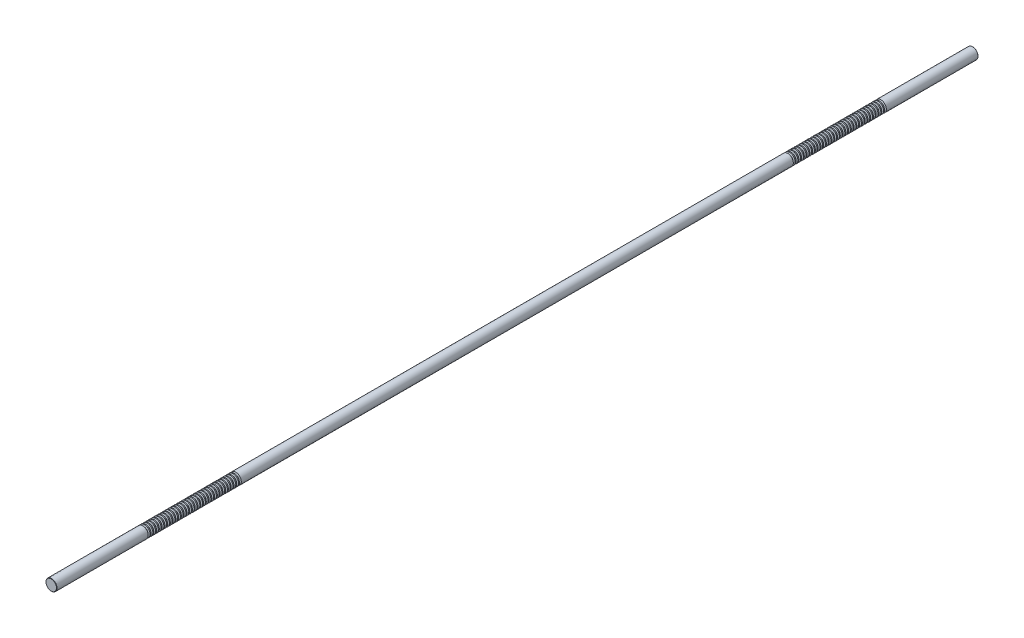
from build123d import *

# Parameters (mm, degrees)
SKETCH1_R           = 6
BOSS_EXTRUDE1_DEPTH = 500
CHAMFER1_SIZE       = 0.3
LPATTERN1_COUNT     = 34
LPATTERN1_PITCH     = 3
LPATTERN2_COUNT     = 2
LPATTERN2_PITCH     = 700


with BuildPart() as part:
    # Sketch1 → Boss-Extrude1 (new, symmetric)
    with BuildSketch(Plane.XY):
        Circle(SKETCH1_R)
    extrude(amount=BOSS_EXTRUDE1_DEPTH, both=True)

    # Chamfer1
    chamfer1_edges = [part.edges().sort_by_distance(p)[0] for p in [
        (-6, 0, -500),
        (-6, 0, 500),
    ]]
    chamfer(chamfer1_edges, length=CHAMFER1_SIZE)

    # Sketch2 → Cut-Revolve1 (revolve, cut)
    with BuildSketch(Plane(origin=(0, 0, 0), x_dir=(0, 0, -1), z_dir=(1, 0, 0)), mode=Mode.PRIVATE) as cut_revolve1_sk:
        Polygon((400.234455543, 6), (398.265544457, 6), (398.734455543, 4.25), (399.765544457, 4.25), align=None)
    cut_revolve1 = revolve(cut_revolve1_sk.sketch.rotate(Axis((0, 0, 500), (0, 0, -1)), 90), axis=Axis((0, 0, 500), (0, 0, -1)), mode=Mode.SUBTRACT)

    # LPattern1: Cut-Revolve1 ×34
    with Locations(*[(0, 0, i * LPATTERN1_PITCH) for i in range(1, LPATTERN1_COUNT)]):
        add(cut_revolve1, mode=Mode.SUBTRACT)

    # LPattern2: Cut-Revolve1 ×2
    with Locations(*[(0, 0, i * LPATTERN2_PITCH) for i in range(1, LPATTERN2_COUNT)]):
        add(cut_revolve1, mode=Mode.SUBTRACT)

    # LPattern2 copy 1 sketch → LPattern2 copy 1 (revolve, cut)
    with BuildSketch(Plane(origin=(0, 0, 703), x_dir=(0, 0, -1), z_dir=(1, 0, 0))):
        Polygon((400.234455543, 6), (398.265544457, 6), (398.734455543, 4.25), (399.765544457, 4.25), align=None)
    revolve(axis=Axis((0, 0, 1203), (0, 0, -1)), mode=Mode.SUBTRACT)

    # LPattern2 copy 2 sketch → LPattern2 copy 2 (revolve, cut)
    with BuildSketch(Plane(origin=(0, 0, 706), x_dir=(0, 0, -1), z_dir=(1, 0, 0))):
        Polygon((400.234455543, 6), (398.265544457, 6), (398.734455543, 4.25), (399.765544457, 4.25), align=None)
    revolve(axis=Axis((0, 0, 1206), (0, 0, -1)), mode=Mode.SUBTRACT)

    # LPattern2 copy 3 sketch → LPattern2 copy 3 (revolve, cut)
    with BuildSketch(Plane(origin=(0, 0, 709), x_dir=(0, 0, -1), z_dir=(1, 0, 0))):
        Polygon((400.234455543, 6), (398.265544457, 6), (398.734455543, 4.25), (399.765544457, 4.25), align=None)
    revolve(axis=Axis((0, 0, 1209), (0, 0, -1)), mode=Mode.SUBTRACT)

    # LPattern2 copy 4 sketch → LPattern2 copy 4 (revolve, cut)
    with BuildSketch(Plane(origin=(0, 0, 712), x_dir=(0, 0, -1), z_dir=(1, 0, 0))):
        Polygon((400.234455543, 6), (398.265544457, 6), (398.734455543, 4.25), (399.765544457, 4.25), align=None)
    revolve(axis=Axis((0, 0, 1212), (0, 0, -1)), mode=Mode.SUBTRACT)

    # LPattern2 copy 5 sketch → LPattern2 copy 5 (revolve, cut)
    with BuildSketch(Plane(origin=(0, 0, 715), x_dir=(0, 0, -1), z_dir=(1, 0, 0))):
        Polygon((400.234455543, 6), (398.265544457, 6), (398.734455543, 4.25), (399.765544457, 4.25), align=None)
    revolve(axis=Axis((0, 0, 1215), (0, 0, -1)), mode=Mode.SUBTRACT)

    # LPattern2 copy 6 sketch → LPattern2 copy 6 (revolve, cut)
    with BuildSketch(Plane(origin=(0, 0, 718), x_dir=(0, 0, -1), z_dir=(1, 0, 0))):
        Polygon((400.234455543, 6), (398.265544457, 6), (398.734455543, 4.25), (399.765544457, 4.25), align=None)
    revolve(axis=Axis((0, 0, 1218), (0, 0, -1)), mode=Mode.SUBTRACT)

    # LPattern2 copy 7 sketch → LPattern2 copy 7 (revolve, cut)
    with BuildSketch(Plane(origin=(0, 0, 721), x_dir=(0, 0, -1), z_dir=(1, 0, 0))):
        Polygon((400.234455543, 6), (398.265544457, 6), (398.734455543, 4.25), (399.765544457, 4.25), align=None)
    revolve(axis=Axis((0, 0, 1221), (0, 0, -1)), mode=Mode.SUBTRACT)

    # LPattern2 copy 8 sketch → LPattern2 copy 8 (revolve, cut)
    with BuildSketch(Plane(origin=(0, 0, 724), x_dir=(0, 0, -1), z_dir=(1, 0, 0))):
        Polygon((400.234455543, 6), (398.265544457, 6), (398.734455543, 4.25), (399.765544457, 4.25), align=None)
    revolve(axis=Axis((0, 0, 1224), (0, 0, -1)), mode=Mode.SUBTRACT)

    # LPattern2 copy 9 sketch → LPattern2 copy 9 (revolve, cut)
    with BuildSketch(Plane(origin=(0, 0, 727), x_dir=(0, 0, -1), z_dir=(1, 0, 0))):
        Polygon((400.234455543, 6), (398.265544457, 6), (398.734455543, 4.25), (399.765544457, 4.25), align=None)
    revolve(axis=Axis((0, 0, 1227), (0, 0, -1)), mode=Mode.SUBTRACT)

    # LPattern2 copy 10 sketch → LPattern2 copy 10 (revolve, cut)
    with BuildSketch(Plane(origin=(0, 0, 730), x_dir=(0, 0, -1), z_dir=(1, 0, 0))):
        Polygon((400.234455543, 6), (398.265544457, 6), (398.734455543, 4.25), (399.765544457, 4.25), align=None)
    revolve(axis=Axis((0, 0, 1230), (0, 0, -1)), mode=Mode.SUBTRACT)

    # LPattern2 copy 11 sketch → LPattern2 copy 11 (revolve, cut)
    with BuildSketch(Plane(origin=(0, 0, 733), x_dir=(0, 0, -1), z_dir=(1, 0, 0))):
        Polygon((400.234455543, 6), (398.265544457, 6), (398.734455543, 4.25), (399.765544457, 4.25), align=None)
    revolve(axis=Axis((0, 0, 1233), (0, 0, -1)), mode=Mode.SUBTRACT)

    # LPattern2 copy 12 sketch → LPattern2 copy 12 (revolve, cut)
    with BuildSketch(Plane(origin=(0, 0, 736), x_dir=(0, 0, -1), z_dir=(1, 0, 0))):
        Polygon((400.234455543, 6), (398.265544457, 6), (398.734455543, 4.25), (399.765544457, 4.25), align=None)
    revolve(axis=Axis((0, 0, 1236), (0, 0, -1)), mode=Mode.SUBTRACT)

    # LPattern2 copy 13 sketch → LPattern2 copy 13 (revolve, cut)
    with BuildSketch(Plane(origin=(0, 0, 739), x_dir=(0, 0, -1), z_dir=(1, 0, 0))):
        Polygon((400.234455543, 6), (398.265544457, 6), (398.734455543, 4.25), (399.765544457, 4.25), align=None)
    revolve(axis=Axis((0, 0, 1239), (0, 0, -1)), mode=Mode.SUBTRACT)

    # LPattern2 copy 14 sketch → LPattern2 copy 14 (revolve, cut)
    with BuildSketch(Plane(origin=(0, 0, 742), x_dir=(0, 0, -1), z_dir=(1, 0, 0))):
        Polygon((400.234455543, 6), (398.265544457, 6), (398.734455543, 4.25), (399.765544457, 4.25), align=None)
    revolve(axis=Axis((0, 0, 1242), (0, 0, -1)), mode=Mode.SUBTRACT)

    # LPattern2 copy 15 sketch → LPattern2 copy 15 (revolve, cut)
    with BuildSketch(Plane(origin=(0, 0, 745), x_dir=(0, 0, -1), z_dir=(1, 0, 0))):
        Polygon((400.234455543, 6), (398.265544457, 6), (398.734455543, 4.25), (399.765544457, 4.25), align=None)
    revolve(axis=Axis((0, 0, 1245), (0, 0, -1)), mode=Mode.SUBTRACT)

    # LPattern2 copy 16 sketch → LPattern2 copy 16 (revolve, cut)
    with BuildSketch(Plane(origin=(0, 0, 748), x_dir=(0, 0, -1), z_dir=(1, 0, 0))):
        Polygon((400.234455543, 6), (398.265544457, 6), (398.734455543, 4.25), (399.765544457, 4.25), align=None)
    revolve(axis=Axis((0, 0, 1248), (0, 0, -1)), mode=Mode.SUBTRACT)

    # LPattern2 copy 17 sketch → LPattern2 copy 17 (revolve, cut)
    with BuildSketch(Plane(origin=(0, 0, 751), x_dir=(0, 0, -1), z_dir=(1, 0, 0))):
        Polygon((400.234455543, 6), (398.265544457, 6), (398.734455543, 4.25), (399.765544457, 4.25), align=None)
    revolve(axis=Axis((0, 0, 1251), (0, 0, -1)), mode=Mode.SUBTRACT)

    # LPattern2 copy 18 sketch → LPattern2 copy 18 (revolve, cut)
    with BuildSketch(Plane(origin=(0, 0, 754), x_dir=(0, 0, -1), z_dir=(1, 0, 0))):
        Polygon((400.234455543, 6), (398.265544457, 6), (398.734455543, 4.25), (399.765544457, 4.25), align=None)
    revolve(axis=Axis((0, 0, 1254), (0, 0, -1)), mode=Mode.SUBTRACT)

    # LPattern2 copy 19 sketch → LPattern2 copy 19 (revolve, cut)
    with BuildSketch(Plane(origin=(0, 0, 757), x_dir=(0, 0, -1), z_dir=(1, 0, 0))):
        Polygon((400.234455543, 6), (398.265544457, 6), (398.734455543, 4.25), (399.765544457, 4.25), align=None)
    revolve(axis=Axis((0, 0, 1257), (0, 0, -1)), mode=Mode.SUBTRACT)

    # LPattern2 copy 20 sketch → LPattern2 copy 20 (revolve, cut)
    with BuildSketch(Plane(origin=(0, 0, 760), x_dir=(0, 0, -1), z_dir=(1, 0, 0))):
        Polygon((400.234455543, 6), (398.265544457, 6), (398.734455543, 4.25), (399.765544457, 4.25), align=None)
    revolve(axis=Axis((0, 0, 1260), (0, 0, -1)), mode=Mode.SUBTRACT)

    # LPattern2 copy 21 sketch → LPattern2 copy 21 (revolve, cut)
    with BuildSketch(Plane(origin=(0, 0, 763), x_dir=(0, 0, -1), z_dir=(1, 0, 0))):
        Polygon((400.234455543, 6), (398.265544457, 6), (398.734455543, 4.25), (399.765544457, 4.25), align=None)
    revolve(axis=Axis((0, 0, 1263), (0, 0, -1)), mode=Mode.SUBTRACT)

    # LPattern2 copy 22 sketch → LPattern2 copy 22 (revolve, cut)
    with BuildSketch(Plane(origin=(0, 0, 766), x_dir=(0, 0, -1), z_dir=(1, 0, 0))):
        Polygon((400.234455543, 6), (398.265544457, 6), (398.734455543, 4.25), (399.765544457, 4.25), align=None)
    revolve(axis=Axis((0, 0, 1266), (0, 0, -1)), mode=Mode.SUBTRACT)

    # LPattern2 copy 23 sketch → LPattern2 copy 23 (revolve, cut)
    with BuildSketch(Plane(origin=(0, 0, 769), x_dir=(0, 0, -1), z_dir=(1, 0, 0))):
        Polygon((400.234455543, 6), (398.265544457, 6), (398.734455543, 4.25), (399.765544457, 4.25), align=None)
    revolve(axis=Axis((0, 0, 1269), (0, 0, -1)), mode=Mode.SUBTRACT)

    # LPattern2 copy 24 sketch → LPattern2 copy 24 (revolve, cut)
    with BuildSketch(Plane(origin=(0, 0, 772), x_dir=(0, 0, -1), z_dir=(1, 0, 0))):
        Polygon((400.234455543, 6), (398.265544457, 6), (398.734455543, 4.25), (399.765544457, 4.25), align=None)
    revolve(axis=Axis((0, 0, 1272), (0, 0, -1)), mode=Mode.SUBTRACT)

    # LPattern2 copy 25 sketch → LPattern2 copy 25 (revolve, cut)
    with BuildSketch(Plane(origin=(0, 0, 775), x_dir=(0, 0, -1), z_dir=(1, 0, 0))):
        Polygon((400.234455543, 6), (398.265544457, 6), (398.734455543, 4.25), (399.765544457, 4.25), align=None)
    revolve(axis=Axis((0, 0, 1275), (0, 0, -1)), mode=Mode.SUBTRACT)

    # LPattern2 copy 26 sketch → LPattern2 copy 26 (revolve, cut)
    with BuildSketch(Plane(origin=(0, 0, 778), x_dir=(0, 0, -1), z_dir=(1, 0, 0))):
        Polygon((400.234455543, 6), (398.265544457, 6), (398.734455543, 4.25), (399.765544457, 4.25), align=None)
    revolve(axis=Axis((0, 0, 1278), (0, 0, -1)), mode=Mode.SUBTRACT)

    # LPattern2 copy 27 sketch → LPattern2 copy 27 (revolve, cut)
    with BuildSketch(Plane(origin=(0, 0, 781), x_dir=(0, 0, -1), z_dir=(1, 0, 0))):
        Polygon((400.234455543, 6), (398.265544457, 6), (398.734455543, 4.25), (399.765544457, 4.25), align=None)
    revolve(axis=Axis((0, 0, 1281), (0, 0, -1)), mode=Mode.SUBTRACT)

    # LPattern2 copy 28 sketch → LPattern2 copy 28 (revolve, cut)
    with BuildSketch(Plane(origin=(0, 0, 784), x_dir=(0, 0, -1), z_dir=(1, 0, 0))):
        Polygon((400.234455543, 6), (398.265544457, 6), (398.734455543, 4.25), (399.765544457, 4.25), align=None)
    revolve(axis=Axis((0, 0, 1284), (0, 0, -1)), mode=Mode.SUBTRACT)

    # LPattern2 copy 29 sketch → LPattern2 copy 29 (revolve, cut)
    with BuildSketch(Plane(origin=(0, 0, 787), x_dir=(0, 0, -1), z_dir=(1, 0, 0))):
        Polygon((400.234455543, 6), (398.265544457, 6), (398.734455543, 4.25), (399.765544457, 4.25), align=None)
    revolve(axis=Axis((0, 0, 1287), (0, 0, -1)), mode=Mode.SUBTRACT)

    # LPattern2 copy 30 sketch → LPattern2 copy 30 (revolve, cut)
    with BuildSketch(Plane(origin=(0, 0, 790), x_dir=(0, 0, -1), z_dir=(1, 0, 0))):
        Polygon((400.234455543, 6), (398.265544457, 6), (398.734455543, 4.25), (399.765544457, 4.25), align=None)
    revolve(axis=Axis((0, 0, 1290), (0, 0, -1)), mode=Mode.SUBTRACT)

    # LPattern2 copy 31 sketch → LPattern2 copy 31 (revolve, cut)
    with BuildSketch(Plane(origin=(0, 0, 793), x_dir=(0, 0, -1), z_dir=(1, 0, 0))):
        Polygon((400.234455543, 6), (398.265544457, 6), (398.734455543, 4.25), (399.765544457, 4.25), align=None)
    revolve(axis=Axis((0, 0, 1293), (0, 0, -1)), mode=Mode.SUBTRACT)

    # LPattern2 copy 32 sketch → LPattern2 copy 32 (revolve, cut)
    with BuildSketch(Plane(origin=(0, 0, 796), x_dir=(0, 0, -1), z_dir=(1, 0, 0))):
        Polygon((400.234455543, 6), (398.265544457, 6), (398.734455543, 4.25), (399.765544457, 4.25), align=None)
    revolve(axis=Axis((0, 0, 1296), (0, 0, -1)), mode=Mode.SUBTRACT)

    # LPattern2 copy 33 sketch → LPattern2 copy 33 (revolve, cut)
    with BuildSketch(Plane(origin=(0, 0, 799), x_dir=(0, 0, -1), z_dir=(1, 0, 0))):
        Polygon((400.234455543, 6), (398.265544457, 6), (398.734455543, 4.25), (399.765544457, 4.25), align=None)
    revolve(axis=Axis((0, 0, 1299), (0, 0, -1)), mode=Mode.SUBTRACT)


solid = part.part
